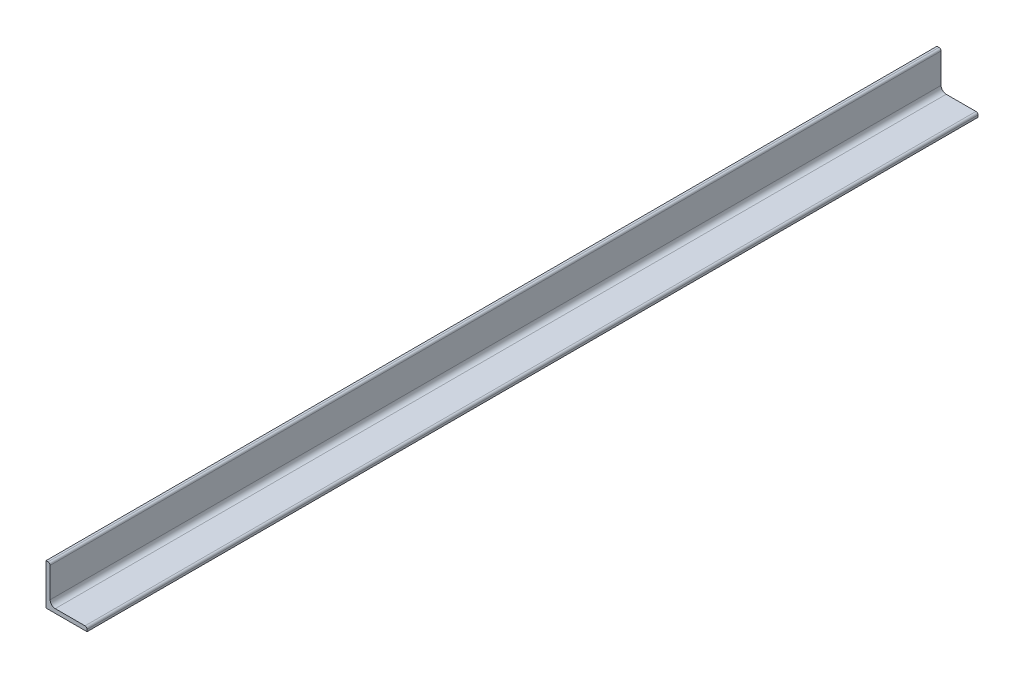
from build123d import *

# Parameters (mm, degrees)
EXTRUDE_1_DEPTH = 868


with BuildPart() as part:
    # Sketch 1 → Extrude 1 (new body)
    with BuildSketch(Plane.XY):
        with BuildLine():
            Line((0, 40), (0, 0))
            Line((0, 0), (40, 0))
            Line((40, 0), (40, 2))
            ThreePointArc((40, 2), (39.414213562, 3.414213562), (38, 4))
            Line((38, 4), (9, 4))
            ThreePointArc((9, 4), (5.464466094, 5.464466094), (4, 9))
            Line((4, 9), (4, 38))
            ThreePointArc((4, 38), (3.414213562, 39.414213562), (2, 40))
            Line((2, 40), (0, 40))
        make_face()
    extrude(amount=EXTRUDE_1_DEPTH)


solid = part.part
